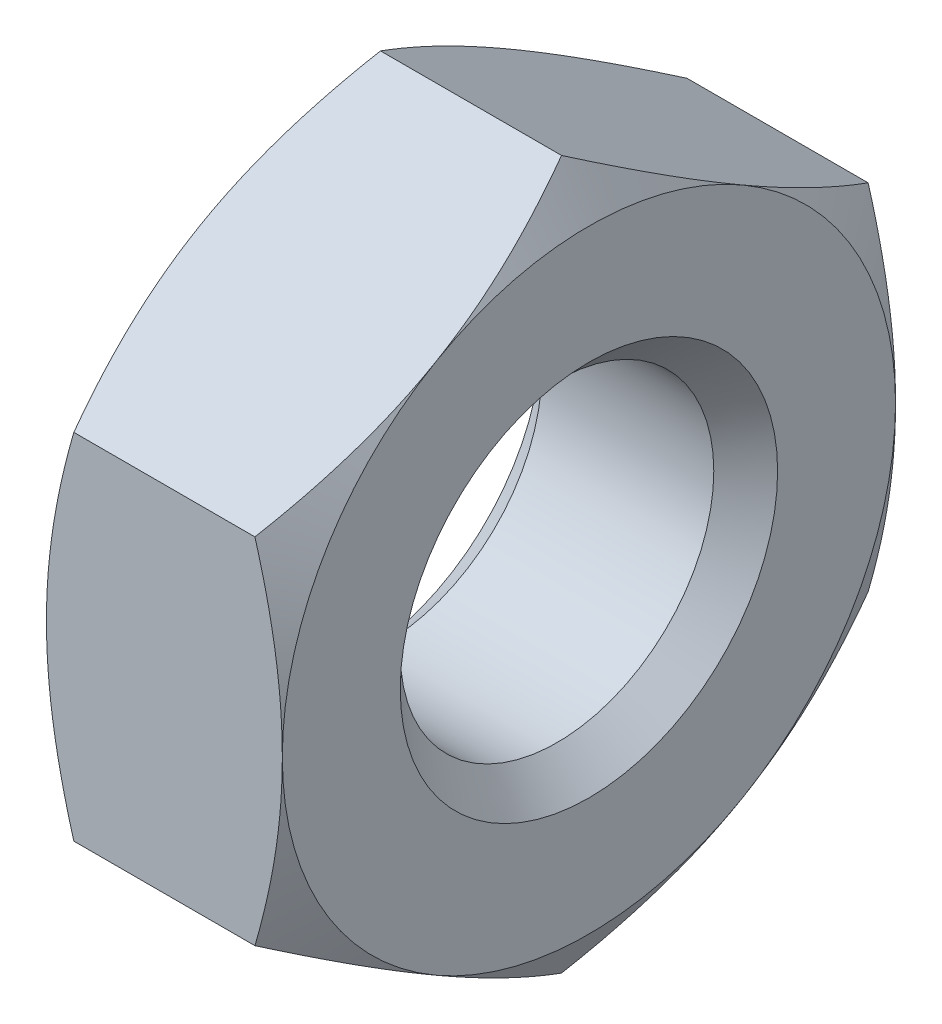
ISO-10303-21;
HEADER;
FILE_DESCRIPTION(('STEP AP214'),'2;1');
FILE_NAME('part.step','',(''),(''),'','','');
FILE_SCHEMA(('AUTOMOTIVE_DESIGN { 1 0 10303 214 1 1 1 1 }'));
ENDSEC;
DATA;
#1=APPLICATION_CONTEXT('core data for automotive mechanical design processes');
#2=APPLICATION_PROTOCOL_DEFINITION('international standard','automotive_design',2000,#1);
#3=PRODUCT_CONTEXT('',#1,'mechanical');
#4=PRODUCT('Part','Part','',(#3));
#5=PRODUCT_RELATED_PRODUCT_CATEGORY('part','',(#4));
#6=PRODUCT_DEFINITION_FORMATION('','',#4);
#7=PRODUCT_DEFINITION_CONTEXT('part definition',#1,'design');
#8=PRODUCT_DEFINITION('design','',#6,#7);
#9=PRODUCT_DEFINITION_SHAPE('','',#8);
#10=(LENGTH_UNIT() NAMED_UNIT(*) SI_UNIT(.MILLI.,.METRE.));
#11=(NAMED_UNIT(*) PLANE_ANGLE_UNIT() SI_UNIT($,.RADIAN.));
#12=(NAMED_UNIT(*) SI_UNIT($,.STERADIAN.) SOLID_ANGLE_UNIT());
#13=UNCERTAINTY_MEASURE_WITH_UNIT(LENGTH_MEASURE(1.E-05),#10,'distance_accuracy_value','');
#14=(GEOMETRIC_REPRESENTATION_CONTEXT(3) GLOBAL_UNCERTAINTY_ASSIGNED_CONTEXT((#13)) GLOBAL_UNIT_ASSIGNED_CONTEXT((#10,
#11,#12)) REPRESENTATION_CONTEXT('',''));
#15=CARTESIAN_POINT('',(0.,0.,0.));
#16=DIRECTION('',(0.,0.,1.));
#17=DIRECTION('',(1.,0.,0.));
#18=AXIS2_PLACEMENT_3D('',#15,#16,#17);
#19=CARTESIAN_POINT('',(0.750555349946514,0.,0.));
#20=DIRECTION('',(1.,0.,0.));
#21=DIRECTION('',(0.,0.,-1.));
#22=AXIS2_PLACEMENT_3D('',#19,#20,#21);
#23=CONICAL_SURFACE('',#22,7.8,1.0471975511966);
#24=CARTESIAN_POINT('',(0.580623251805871,-3.75266127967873,-6.5002));
#25=CARTESIAN_POINT('',(0.53300442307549,-3.83515161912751,-6.35732254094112));
#26=CARTESIAN_POINT('',(0.487546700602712,-3.91794952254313,-6.21391236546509));
#27=CARTESIAN_POINT('',(0.401548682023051,-4.08421773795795,-5.92592736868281));
#28=CARTESIAN_POINT('',(0.36101050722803,-4.16768832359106,-5.78135207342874));
#29=CARTESIAN_POINT('',(0.247571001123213,-4.41943655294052,-5.34531134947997));
#30=CARTESIAN_POINT('',(0.183047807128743,-4.5887079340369,-5.05212471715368));
#31=CARTESIAN_POINT('',(0.107386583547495,-4.84201947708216,-4.61337625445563));
#32=CARTESIAN_POINT('',(0.085832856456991,-4.92530276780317,-4.46912536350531));
#33=CARTESIAN_POINT('',(0.0496903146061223,-5.09224566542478,-4.17997178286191));
#34=CARTESIAN_POINT('',(0.0351008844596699,-5.17590523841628,-4.03506915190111));
#35=CARTESIAN_POINT('',(0.0132587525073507,-5.34336968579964,-3.74501222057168));
#36=CARTESIAN_POINT('',(0.00599772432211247,-5.42717428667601,-3.59985839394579));
#37=CARTESIAN_POINT('',(-0.00103969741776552,-5.59485627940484,-3.30942466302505));
#38=CARTESIAN_POINT('',(-0.000816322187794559,-5.6787336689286,-3.16414476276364));
#39=CARTESIAN_POINT('',(0.010083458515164,-5.90853103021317,-2.7661240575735));
#40=CARTESIAN_POINT('',(0.0283818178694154,-6.05437578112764,-2.51351353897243));
#41=CARTESIAN_POINT('',(0.0864063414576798,-6.34509659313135,-2.00997032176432));
#42=CARTESIAN_POINT('',(0.126152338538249,-6.48997163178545,-1.75903939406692));
#43=CARTESIAN_POINT('',(0.225505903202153,-6.78127752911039,-1.25448277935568));
#44=CARTESIAN_POINT('',(0.285534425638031,-6.92767163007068,-1.00092075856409));
#45=CARTESIAN_POINT('',(0.421774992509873,-7.21827667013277,-0.497578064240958));
#46=CARTESIAN_POINT('',(0.497955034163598,-7.36249133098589,-0.247790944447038));
#47=CARTESIAN_POINT('',(0.58062325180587,-7.50566896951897,0.000199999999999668));
#48=B_SPLINE_CURVE_WITH_KNOTS('',3,(#24,#25,#26,#27,#28,#29,#30,#31,#32,#33,#34,#35,#36,#37,#38,
#39,#40,#41,#42,#43,#44,#45,#46,#47),.UNSPECIFIED.,.F.,.F.,(4,2,2,2,2,2,2,2,2,2,2,4),(0.,
0.515105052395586,1.03043143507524,2.06322554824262,2.56697389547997,3.07067772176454,
3.57380860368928,4.0769239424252,4.9527935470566,5.82947446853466,6.72559912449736,
7.61996451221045),.UNSPECIFIED.);
#49=CARTESIAN_POINT('',(0.,-5.62916512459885,-3.25));
#50=VERTEX_POINT('',#49);
#51=CARTESIAN_POINT('',(0.580556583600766,-7.50555349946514,0.));
#52=VERTEX_POINT('',#51);
#53=EDGE_CURVE('E274',#50,#52,#48,.T.);
#54=ORIENTED_EDGE('',*,*,#53,.T.);
#55=CARTESIAN_POINT('',(0.58062325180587,-7.50566896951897,-0.000199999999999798));
#56=CARTESIAN_POINT('',(0.533004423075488,-7.4231786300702,0.142677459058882));
#57=CARTESIAN_POINT('',(0.487546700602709,-7.34038072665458,0.286087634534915));
#58=CARTESIAN_POINT('',(0.401548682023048,-7.17411251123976,0.574072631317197));
#59=CARTESIAN_POINT('',(0.361010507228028,-7.09064192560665,0.718647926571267));
#60=CARTESIAN_POINT('',(0.247571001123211,-6.83889369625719,1.15468865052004));
#61=CARTESIAN_POINT('',(0.183047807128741,-6.66962231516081,1.44787528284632));
#62=CARTESIAN_POINT('',(0.107386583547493,-6.41631077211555,1.88662374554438));
#63=CARTESIAN_POINT('',(0.085832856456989,-6.33302748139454,2.03087463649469));
#64=CARTESIAN_POINT('',(0.0496903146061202,-6.16608458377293,2.32002821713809));
#65=CARTESIAN_POINT('',(0.0351008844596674,-6.08242501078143,2.46493084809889));
#66=CARTESIAN_POINT('',(0.0132587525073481,-5.91496056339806,2.75498777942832));
#67=CARTESIAN_POINT('',(0.00599772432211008,-5.8311559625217,2.90014160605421));
#68=CARTESIAN_POINT('',(-0.00103969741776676,-5.66347396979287,3.19057533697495));
#69=CARTESIAN_POINT('',(-0.00081632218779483,-5.5795965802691,3.33585523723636));
#70=CARTESIAN_POINT('',(0.0100834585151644,-5.34979921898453,3.7338759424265));
#71=CARTESIAN_POINT('',(0.0283818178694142,-5.20395446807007,3.98648646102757));
#72=CARTESIAN_POINT('',(0.0864063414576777,-4.91323365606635,4.49002967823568));
#73=CARTESIAN_POINT('',(0.126152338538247,-4.76835861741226,4.74096060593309));
#74=CARTESIAN_POINT('',(0.225505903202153,-4.47705272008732,5.24551722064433));
#75=CARTESIAN_POINT('',(0.28553442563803,-4.33065861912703,5.49907924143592));
#76=CARTESIAN_POINT('',(0.421774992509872,-4.04005357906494,6.00242193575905));
#77=CARTESIAN_POINT('',(0.497955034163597,-3.89583891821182,6.25220905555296));
#78=CARTESIAN_POINT('',(0.58062325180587,-3.75266127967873,6.5002));
#79=B_SPLINE_CURVE_WITH_KNOTS('',3,(#55,#56,#57,#58,#59,#60,#61,#62,#63,#64,#65,#66,#67,#68,#69,
#70,#71,#72,#73,#74,#75,#76,#77,#78),.UNSPECIFIED.,.F.,.F.,(4,2,2,2,2,2,2,2,2,2,2,4),(0.,
0.515105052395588,1.03043143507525,2.06322554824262,2.56697389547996,3.07067772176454,
3.57380860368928,4.0769239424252,4.9527935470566,5.82947446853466,6.72559912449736,
7.61996451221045),.UNSPECIFIED.);
#80=CARTESIAN_POINT('',(0.,-5.62916512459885,3.25));
#81=VERTEX_POINT('',#80);
#82=EDGE_CURVE('E222',#52,#81,#79,.T.);
#83=ORIENTED_EDGE('',*,*,#82,.T.);
#84=CARTESIAN_POINT('',(0.,0.,0.));
#85=DIRECTION('',(-1.,0.,0.));
#86=DIRECTION('',(0.,0.,1.));
#87=AXIS2_PLACEMENT_3D('',#84,#85,#86);
#88=CIRCLE('',#87,6.5);
#89=EDGE_CURVE('E252',#50,#81,#88,.T.);
#90=ORIENTED_EDGE('',*,*,#89,.F.);
#91=EDGE_LOOP('',(#54,#83,#90));
#92=FACE_BOUND('',#91,.T.);
#93=ADVANCED_FACE('F16',(#92),#23,.T.);
#94=CARTESIAN_POINT('',(0.,0.,6.5));
#95=VERTEX_POINT('',#94);
#96=EDGE_CURVE('E25',#81,#95,#88,.T.);
#97=ORIENTED_EDGE('',*,*,#96,.F.);
#98=CARTESIAN_POINT('',(0.580556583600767,-3.75277674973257,6.5));
#99=VERTEX_POINT('',#98);
#100=EDGE_CURVE('E223',#81,#99,#79,.T.);
#101=ORIENTED_EDGE('',*,*,#100,.T.);
#102=CARTESIAN_POINT('',(3.12183501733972,-9.97651546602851,6.5));
#103=CARTESIAN_POINT('',(2.98495508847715,-9.6934728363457,6.5));
#104=CARTESIAN_POINT('',(2.84941805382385,-9.40976918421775,6.5));
#105=CARTESIAN_POINT('',(2.58178722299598,-8.84068788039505,6.5));
#106=CARTESIAN_POINT('',(2.44969399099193,-8.55530996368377,6.5));
#107=CARTESIAN_POINT('',(2.18902122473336,-7.98100727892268,6.5));
#108=CARTESIAN_POINT('',(2.0604656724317,-7.6920715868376,6.5));
#109=CARTESIAN_POINT('',(1.80875631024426,-7.11186545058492,6.5));
#110=CARTESIAN_POINT('',(1.68560223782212,-6.82059512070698,6.5));
#111=CARTESIAN_POINT('',(1.4424463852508,-6.22626365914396,6.5));
#112=CARTESIAN_POINT('',(1.3226573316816,-5.92311500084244,6.5));
#113=CARTESIAN_POINT('',(1.09239953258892,-5.31323360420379,6.5));
#114=CARTESIAN_POINT('',(0.981931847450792,-5.00650046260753,6.5));
#115=CARTESIAN_POINT('',(0.773293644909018,-4.3895669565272,6.5));
#116=CARTESIAN_POINT('',(0.675097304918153,-4.0793754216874,6.5));
#117=CARTESIAN_POINT('',(0.494219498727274,-3.45455611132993,6.5));
#118=CARTESIAN_POINT('',(0.411533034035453,-3.13992980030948,6.5));
#119=CARTESIAN_POINT('',(0.266150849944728,-2.50773581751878,6.5));
#120=CARTESIAN_POINT('',(0.2033506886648,-2.1901928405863,6.5));
#121=CARTESIAN_POINT('',(0.126834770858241,-1.71107137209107,6.5));
#122=CARTESIAN_POINT('',(0.10427576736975,-1.55088359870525,6.5));
#123=CARTESIAN_POINT('',(0.0654973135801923,-1.22974840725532,6.5));
#124=CARTESIAN_POINT('',(0.0492772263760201,-1.06880106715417,6.5));
#125=CARTESIAN_POINT('',(0.0236976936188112,-0.748417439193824,6.5));
#126=CARTESIAN_POINT('',(0.0142537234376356,-0.588987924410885,6.5));
#127=CARTESIAN_POINT('',(0.00210835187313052,-0.269872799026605,6.5));
#128=CARTESIAN_POINT('',(-0.000593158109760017,-0.11018719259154,6.5));
#129=CARTESIAN_POINT('',(0.000810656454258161,0.209155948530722,6.5));
#130=CARTESIAN_POINT('',(0.00491602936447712,0.368813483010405,6.5));
#131=CARTESIAN_POINT('',(0.0198352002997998,0.687816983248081,6.5));
#132=CARTESIAN_POINT('',(0.0306493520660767,0.847162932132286,6.5));
#133=CARTESIAN_POINT('',(0.0647613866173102,1.23333266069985,6.5));
#134=CARTESIAN_POINT('',(0.0914204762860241,1.45986546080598,6.5));
#135=CARTESIAN_POINT('',(0.156818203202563,1.91116991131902,6.5));
#136=CARTESIAN_POINT('',(0.195558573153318,2.13594130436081,6.5));
#137=CARTESIAN_POINT('',(0.327840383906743,2.80740180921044,6.5));
#138=CARTESIAN_POINT('',(0.437415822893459,3.25096947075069,6.5));
#139=CARTESIAN_POINT('',(0.626414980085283,3.91407602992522,6.5));
#140=CARTESIAN_POINT('',(0.694374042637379,4.137079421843,6.5));
#141=CARTESIAN_POINT('',(0.837098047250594,4.58091888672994,6.5));
#142=CARTESIAN_POINT('',(0.911863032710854,4.80175494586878,6.5));
#143=CARTESIAN_POINT('',(1.06702048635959,5.2413340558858,6.5));
#144=CARTESIAN_POINT('',(1.14741093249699,5.46007782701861,6.5));
#145=CARTESIAN_POINT('',(1.31289876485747,5.89577034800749,6.5));
#146=CARTESIAN_POINT('',(1.39799610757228,6.1127191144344,6.5));
#147=CARTESIAN_POINT('',(1.59636244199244,6.60523427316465,6.5));
#148=CARTESIAN_POINT('',(1.71087670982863,6.88029803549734,6.5));
#149=CARTESIAN_POINT('',(1.94502641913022,7.42824284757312,6.5));
#150=CARTESIAN_POINT('',(2.06466210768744,7.7011237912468,6.5));
#151=CARTESIAN_POINT('',(2.30807643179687,8.24508157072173,6.5));
#152=CARTESIAN_POINT('',(2.43185575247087,8.51615809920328,6.5));
#153=CARTESIAN_POINT('',(2.6827757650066,9.0567531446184,6.5));
#154=CARTESIAN_POINT('',(2.80991651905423,9.32627163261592,6.5));
#155=CARTESIAN_POINT('',(3.19566804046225,10.1333232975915,6.5));
#156=CARTESIAN_POINT('',(3.45839707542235,10.6688870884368,6.5));
#157=CARTESIAN_POINT('',(3.9914219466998,11.7362351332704,6.5));
#158=CARTESIAN_POINT('',(4.26171803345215,12.268019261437,6.5));
#159=CARTESIAN_POINT('',(4.66061827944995,13.0429212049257,6.5));
#160=CARTESIAN_POINT('',(4.78707421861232,13.2871481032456,6.5));
#161=CARTESIAN_POINT('',(5.04099732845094,13.7750704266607,6.5));
#162=CARTESIAN_POINT('',(5.16846448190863,14.0187658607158,6.5));
#163=CARTESIAN_POINT('',(5.5521928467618,14.749177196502,6.5));
#164=CARTESIAN_POINT('',(5.80977200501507,15.235200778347,6.5));
#165=CARTESIAN_POINT('',(6.32705877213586,16.2047384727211,6.5));
#166=CARTESIAN_POINT('',(6.5867604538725,16.6882557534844,6.5));
#167=CARTESIAN_POINT('',(7.10829861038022,17.6541075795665,6.5));
#168=CARTESIAN_POINT('',(7.37013498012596,18.1364421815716,6.5));
#169=CARTESIAN_POINT('',(7.63277579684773,18.6183355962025,6.5));
#170=B_SPLINE_CURVE_WITH_KNOTS('',3,(#102,#103,#104,#105,#106,#107,#108,#109,#110,#111,#112,
#113,#114,#115,#116,#117,#118,#119,#120,#121,#122,#123,#124,#125,#126,#127,#128,#129,#130,#131,
#132,#133,#134,#135,#136,#137,#138,#139,#140,#141,#142,#143,#144,#145,#146,#147,#148,#149,#150,
#151,#152,#153,#154,#155,#156,#157,#158,#159,#160,#161,#162,#163,#164,#165,#166,#167,#168,#169),
.UNSPECIFIED.,.F.,.F.,(4,2,2,2,2,2,2,2,2,2,2,2,2,2,2,2,2,2,2,2,2,2,2,2,2,2,2,2,2,2,2,2,2,4),(0.,
0.943221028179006,1.8865956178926,2.83528383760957,3.78392589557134,4.76168061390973,
5.7395464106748,6.71531853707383,7.69077565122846,8.66102131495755,9.1462209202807,
9.63137176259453,10.1103603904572,10.5893413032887,11.0683256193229,11.5473351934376,
12.231234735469,12.9152324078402,14.2840314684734,14.983362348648,15.6826976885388,
16.3817829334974,17.0808617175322,17.9746407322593,18.8684629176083,19.7624336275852,
20.6564208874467,22.4459285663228,24.2354955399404,25.0605638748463,25.8856181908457,
27.5357854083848,29.1823233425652,30.828780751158),.UNSPECIFIED.);
#171=EDGE_CURVE('E232',#99,#95,#170,.T.);
#172=ORIENTED_EDGE('',*,*,#171,.T.);
#173=EDGE_LOOP('',(#97,#101,#172));
#174=FACE_BOUND('',#173,.T.);
#175=ADVANCED_FACE('F310',(#174),#23,.T.);
#176=CARTESIAN_POINT('',(0.,5.62916512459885,3.25));
#177=VERTEX_POINT('',#176);
#178=EDGE_CURVE('E11',#95,#177,#88,.T.);
#179=ORIENTED_EDGE('',*,*,#178,.F.);
#180=CARTESIAN_POINT('',(0.580556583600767,3.75277674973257,6.5));
#181=VERTEX_POINT('',#180);
#182=EDGE_CURVE('E135',#95,#181,#170,.T.);
#183=ORIENTED_EDGE('',*,*,#182,.T.);
#184=CARTESIAN_POINT('',(0.580623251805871,3.75266127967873,6.5002));
#185=CARTESIAN_POINT('',(0.53300442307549,3.83515161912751,6.35732254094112));
#186=CARTESIAN_POINT('',(0.487546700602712,3.91794952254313,6.21391236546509));
#187=CARTESIAN_POINT('',(0.401548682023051,4.08421773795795,5.92592736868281));
#188=CARTESIAN_POINT('',(0.36101050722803,4.16768832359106,5.78135207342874));
#189=CARTESIAN_POINT('',(0.247571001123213,4.41943655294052,5.34531134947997));
#190=CARTESIAN_POINT('',(0.183047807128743,4.5887079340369,5.05212471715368));
#191=CARTESIAN_POINT('',(0.107386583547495,4.84201947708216,4.61337625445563));
#192=CARTESIAN_POINT('',(0.085832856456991,4.92530276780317,4.46912536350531));
#193=CARTESIAN_POINT('',(0.0496903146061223,5.09224566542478,4.17997178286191));
#194=CARTESIAN_POINT('',(0.0351008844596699,5.17590523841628,4.03506915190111));
#195=CARTESIAN_POINT('',(0.0132587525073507,5.34336968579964,3.74501222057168));
#196=CARTESIAN_POINT('',(0.00599772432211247,5.42717428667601,3.59985839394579));
#197=CARTESIAN_POINT('',(-0.00103969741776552,5.59485627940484,3.30942466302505));
#198=CARTESIAN_POINT('',(-0.000816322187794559,5.6787336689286,3.16414476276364));
#199=CARTESIAN_POINT('',(0.010083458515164,5.90853103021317,2.7661240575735));
#200=CARTESIAN_POINT('',(0.0283818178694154,6.05437578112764,2.51351353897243));
#201=CARTESIAN_POINT('',(0.0864063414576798,6.34509659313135,2.00997032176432));
#202=CARTESIAN_POINT('',(0.126152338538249,6.48997163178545,1.75903939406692));
#203=CARTESIAN_POINT('',(0.225505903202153,6.78127752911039,1.25448277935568));
#204=CARTESIAN_POINT('',(0.285534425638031,6.92767163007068,1.00092075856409));
#205=CARTESIAN_POINT('',(0.421774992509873,7.21827667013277,0.497578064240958));
#206=CARTESIAN_POINT('',(0.497955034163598,7.36249133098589,0.247790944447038));
#207=CARTESIAN_POINT('',(0.58062325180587,7.50566896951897,-0.000199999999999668));
#208=B_SPLINE_CURVE_WITH_KNOTS('',3,(#184,#185,#186,#187,#188,#189,#190,#191,#192,#193,#194,
#195,#196,#197,#198,#199,#200,#201,#202,#203,#204,#205,#206,#207),.UNSPECIFIED.,.F.,.F.,(4,2,2,
2,2,2,2,2,2,2,2,4),(0.,0.515105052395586,1.03043143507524,2.06322554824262,2.56697389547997,
3.07067772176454,3.57380860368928,4.0769239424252,4.9527935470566,5.82947446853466,
6.72559912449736,7.61996451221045),.UNSPECIFIED.);
#209=EDGE_CURVE('E136',#181,#177,#208,.T.);
#210=ORIENTED_EDGE('',*,*,#209,.T.);
#211=EDGE_LOOP('',(#179,#183,#210));
#212=FACE_BOUND('',#211,.T.);
#213=ADVANCED_FACE('F134',(#212),#23,.T.);
#214=CARTESIAN_POINT('',(3.12183501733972,-9.97651546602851,-6.5));
#215=CARTESIAN_POINT('',(2.98495508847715,-9.6934728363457,-6.5));
#216=CARTESIAN_POINT('',(2.84941805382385,-9.40976918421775,-6.5));
#217=CARTESIAN_POINT('',(2.58178722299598,-8.84068788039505,-6.5));
#218=CARTESIAN_POINT('',(2.44969399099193,-8.55530996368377,-6.5));
#219=CARTESIAN_POINT('',(2.18902122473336,-7.98100727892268,-6.5));
#220=CARTESIAN_POINT('',(2.0604656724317,-7.6920715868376,-6.5));
#221=CARTESIAN_POINT('',(1.80875631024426,-7.11186545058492,-6.5));
#222=CARTESIAN_POINT('',(1.68560223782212,-6.82059512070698,-6.5));
#223=CARTESIAN_POINT('',(1.4424463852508,-6.22626365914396,-6.5));
#224=CARTESIAN_POINT('',(1.3226573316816,-5.92311500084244,-6.5));
#225=CARTESIAN_POINT('',(1.09239953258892,-5.31323360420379,-6.5));
#226=CARTESIAN_POINT('',(0.981931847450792,-5.00650046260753,-6.5));
#227=CARTESIAN_POINT('',(0.773293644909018,-4.3895669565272,-6.5));
#228=CARTESIAN_POINT('',(0.675097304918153,-4.0793754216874,-6.5));
#229=CARTESIAN_POINT('',(0.494219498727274,-3.45455611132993,-6.5));
#230=CARTESIAN_POINT('',(0.411533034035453,-3.13992980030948,-6.5));
#231=CARTESIAN_POINT('',(0.266150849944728,-2.50773581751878,-6.5));
#232=CARTESIAN_POINT('',(0.2033506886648,-2.1901928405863,-6.5));
#233=CARTESIAN_POINT('',(0.126834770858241,-1.71107137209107,-6.5));
#234=CARTESIAN_POINT('',(0.10427576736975,-1.55088359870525,-6.5));
#235=CARTESIAN_POINT('',(0.0654973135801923,-1.22974840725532,-6.5));
#236=CARTESIAN_POINT('',(0.0492772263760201,-1.06880106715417,-6.5));
#237=CARTESIAN_POINT('',(0.0236976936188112,-0.748417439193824,-6.5));
#238=CARTESIAN_POINT('',(0.0142537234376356,-0.588987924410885,-6.5));
#239=CARTESIAN_POINT('',(0.00210835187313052,-0.269872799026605,-6.5));
#240=CARTESIAN_POINT('',(-0.000593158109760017,-0.11018719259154,-6.5));
#241=CARTESIAN_POINT('',(0.000810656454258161,0.209155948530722,-6.5));
#242=CARTESIAN_POINT('',(0.00491602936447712,0.368813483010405,-6.5));
#243=CARTESIAN_POINT('',(0.0198352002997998,0.687816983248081,-6.5));
#244=CARTESIAN_POINT('',(0.0306493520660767,0.847162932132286,-6.5));
#245=CARTESIAN_POINT('',(0.0647613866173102,1.23333266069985,-6.5));
#246=CARTESIAN_POINT('',(0.0914204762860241,1.45986546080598,-6.5));
#247=CARTESIAN_POINT('',(0.156818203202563,1.91116991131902,-6.5));
#248=CARTESIAN_POINT('',(0.195558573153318,2.13594130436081,-6.5));
#249=CARTESIAN_POINT('',(0.327840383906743,2.80740180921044,-6.5));
#250=CARTESIAN_POINT('',(0.437415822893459,3.25096947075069,-6.5));
#251=CARTESIAN_POINT('',(0.626414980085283,3.91407602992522,-6.5));
#252=CARTESIAN_POINT('',(0.694374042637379,4.137079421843,-6.5));
#253=CARTESIAN_POINT('',(0.837098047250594,4.58091888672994,-6.5));
#254=CARTESIAN_POINT('',(0.911863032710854,4.80175494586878,-6.5));
#255=CARTESIAN_POINT('',(1.06702048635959,5.2413340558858,-6.5));
#256=CARTESIAN_POINT('',(1.14741093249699,5.46007782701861,-6.5));
#257=CARTESIAN_POINT('',(1.31289876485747,5.89577034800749,-6.5));
#258=CARTESIAN_POINT('',(1.39799610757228,6.1127191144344,-6.5));
#259=CARTESIAN_POINT('',(1.59636244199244,6.60523427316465,-6.5));
#260=CARTESIAN_POINT('',(1.71087670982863,6.88029803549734,-6.5));
#261=CARTESIAN_POINT('',(1.94502641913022,7.42824284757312,-6.5));
#262=CARTESIAN_POINT('',(2.06466210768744,7.7011237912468,-6.5));
#263=CARTESIAN_POINT('',(2.30807643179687,8.24508157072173,-6.5));
#264=CARTESIAN_POINT('',(2.43185575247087,8.51615809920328,-6.5));
#265=CARTESIAN_POINT('',(2.6827757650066,9.0567531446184,-6.5));
#266=CARTESIAN_POINT('',(2.80991651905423,9.32627163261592,-6.5));
#267=CARTESIAN_POINT('',(3.19566804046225,10.1333232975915,-6.5));
#268=CARTESIAN_POINT('',(3.45839707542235,10.6688870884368,-6.5));
#269=CARTESIAN_POINT('',(3.9914219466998,11.7362351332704,-6.5));
#270=CARTESIAN_POINT('',(4.26171803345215,12.268019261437,-6.5));
#271=CARTESIAN_POINT('',(4.66061827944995,13.0429212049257,-6.5));
#272=CARTESIAN_POINT('',(4.78707421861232,13.2871481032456,-6.5));
#273=CARTESIAN_POINT('',(5.04099732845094,13.7750704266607,-6.5));
#274=CARTESIAN_POINT('',(5.16846448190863,14.0187658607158,-6.5));
#275=CARTESIAN_POINT('',(5.5521928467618,14.749177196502,-6.5));
#276=CARTESIAN_POINT('',(5.80977200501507,15.235200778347,-6.5));
#277=CARTESIAN_POINT('',(6.32705877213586,16.2047384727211,-6.5));
#278=CARTESIAN_POINT('',(6.5867604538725,16.6882557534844,-6.5));
#279=CARTESIAN_POINT('',(7.10829861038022,17.6541075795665,-6.5));
#280=CARTESIAN_POINT('',(7.37013498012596,18.1364421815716,-6.5));
#281=CARTESIAN_POINT('',(7.63277579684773,18.6183355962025,-6.5));
#282=B_SPLINE_CURVE_WITH_KNOTS('',3,(#214,#215,#216,#217,#218,#219,#220,#221,#222,#223,#224,
#225,#226,#227,#228,#229,#230,#231,#232,#233,#234,#235,#236,#237,#238,#239,#240,#241,#242,#243,
#244,#245,#246,#247,#248,#249,#250,#251,#252,#253,#254,#255,#256,#257,#258,#259,#260,#261,#262,
#263,#264,#265,#266,#267,#268,#269,#270,#271,#272,#273,#274,#275,#276,#277,#278,#279,#280,#281),
.UNSPECIFIED.,.F.,.F.,(4,2,2,2,2,2,2,2,2,2,2,2,2,2,2,2,2,2,2,2,2,2,2,2,2,2,2,2,2,2,2,2,2,4),(0.,
0.943221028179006,1.8865956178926,2.83528383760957,3.78392589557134,4.76168061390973,
5.7395464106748,6.71531853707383,7.69077565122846,8.66102131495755,9.1462209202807,
9.63137176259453,10.1103603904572,10.5893413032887,11.0683256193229,11.5473351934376,
12.231234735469,12.9152324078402,14.2840314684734,14.983362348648,15.6826976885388,
16.3817829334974,17.0808617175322,17.9746407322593,18.8684629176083,19.7624336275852,
20.6564208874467,22.4459285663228,24.2354955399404,25.0605638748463,25.8856181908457,
27.5357854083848,29.1823233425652,30.828780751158),.UNSPECIFIED.);
#283=CARTESIAN_POINT('',(0.,0.,-6.5));
#284=VERTEX_POINT('',#283);
#285=CARTESIAN_POINT('',(0.580556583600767,-3.75277674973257,-6.5));
#286=VERTEX_POINT('',#285);
#287=EDGE_CURVE('E277',#284,#286,#282,.F.);
#288=ORIENTED_EDGE('',*,*,#287,.T.);
#289=EDGE_CURVE('E276',#286,#50,#48,.T.);
#290=ORIENTED_EDGE('',*,*,#289,.T.);
#291=EDGE_CURVE('E126',#284,#50,#88,.T.);
#292=ORIENTED_EDGE('',*,*,#291,.F.);
#293=EDGE_LOOP('',(#288,#290,#292));
#294=FACE_BOUND('',#293,.T.);
#295=ADVANCED_FACE('F324',(#294),#23,.T.);
#296=CARTESIAN_POINT('',(0.,5.62916512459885,-3.25));
#297=VERTEX_POINT('',#296);
#298=EDGE_CURVE('E24',#177,#297,#88,.T.);
#299=ORIENTED_EDGE('',*,*,#298,.F.);
#300=CARTESIAN_POINT('',(0.580556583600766,7.50555349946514,0.));
#301=VERTEX_POINT('',#300);
#302=EDGE_CURVE('E117',#177,#301,#208,.T.);
#303=ORIENTED_EDGE('',*,*,#302,.T.);
#304=CARTESIAN_POINT('',(0.58062325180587,7.50566896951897,0.000199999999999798));
#305=CARTESIAN_POINT('',(0.533004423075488,7.4231786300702,-0.142677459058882));
#306=CARTESIAN_POINT('',(0.487546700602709,7.34038072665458,-0.286087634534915));
#307=CARTESIAN_POINT('',(0.401548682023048,7.17411251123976,-0.574072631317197));
#308=CARTESIAN_POINT('',(0.361010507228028,7.09064192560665,-0.718647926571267));
#309=CARTESIAN_POINT('',(0.247571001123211,6.83889369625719,-1.15468865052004));
#310=CARTESIAN_POINT('',(0.183047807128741,6.66962231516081,-1.44787528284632));
#311=CARTESIAN_POINT('',(0.107386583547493,6.41631077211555,-1.88662374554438));
#312=CARTESIAN_POINT('',(0.085832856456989,6.33302748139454,-2.03087463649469));
#313=CARTESIAN_POINT('',(0.0496903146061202,6.16608458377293,-2.32002821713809));
#314=CARTESIAN_POINT('',(0.0351008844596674,6.08242501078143,-2.46493084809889));
#315=CARTESIAN_POINT('',(0.0132587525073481,5.91496056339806,-2.75498777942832));
#316=CARTESIAN_POINT('',(0.00599772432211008,5.8311559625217,-2.90014160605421));
#317=CARTESIAN_POINT('',(-0.00103969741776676,5.66347396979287,-3.19057533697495));
#318=CARTESIAN_POINT('',(-0.00081632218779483,5.5795965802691,-3.33585523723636));
#319=CARTESIAN_POINT('',(0.0100834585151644,5.34979921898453,-3.7338759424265));
#320=CARTESIAN_POINT('',(0.0283818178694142,5.20395446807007,-3.98648646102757));
#321=CARTESIAN_POINT('',(0.0864063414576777,4.91323365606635,-4.49002967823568));
#322=CARTESIAN_POINT('',(0.126152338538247,4.76835861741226,-4.74096060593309));
#323=CARTESIAN_POINT('',(0.225505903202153,4.47705272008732,-5.24551722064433));
#324=CARTESIAN_POINT('',(0.28553442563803,4.33065861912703,-5.49907924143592));
#325=CARTESIAN_POINT('',(0.421774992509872,4.04005357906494,-6.00242193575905));
#326=CARTESIAN_POINT('',(0.497955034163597,3.89583891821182,-6.25220905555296));
#327=CARTESIAN_POINT('',(0.58062325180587,3.75266127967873,-6.5002));
#328=B_SPLINE_CURVE_WITH_KNOTS('',3,(#304,#305,#306,#307,#308,#309,#310,#311,#312,#313,#314,
#315,#316,#317,#318,#319,#320,#321,#322,#323,#324,#325,#326,#327),.UNSPECIFIED.,.F.,.F.,(4,2,2,
2,2,2,2,2,2,2,2,4),(0.,0.515105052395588,1.03043143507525,2.06322554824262,2.56697389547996,
3.07067772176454,3.57380860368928,4.0769239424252,4.9527935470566,5.82947446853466,
6.72559912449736,7.61996451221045),.UNSPECIFIED.);
#329=EDGE_CURVE('E106',#301,#297,#328,.T.);
#330=ORIENTED_EDGE('',*,*,#329,.T.);
#331=EDGE_LOOP('',(#299,#303,#330));
#332=FACE_BOUND('',#331,.T.);
#333=ADVANCED_FACE('F115',(#332),#23,.T.);
#334=CARTESIAN_POINT('',(0.,0.,0.));
#335=DIRECTION('',(1.,0.,0.));
#336=DIRECTION('',(0.,0.,-1.));
#337=AXIS2_PLACEMENT_3D('',#334,#335,#336);
#338=PLANE('',#337);
#339=CARTESIAN_POINT('',(0.,0.,0.));
#340=DIRECTION('',(-1.,0.,0.));
#341=DIRECTION('',(0.,0.,1.));
#342=AXIS2_PLACEMENT_3D('',#339,#340,#341);
#343=CIRCLE('',#342,4.);
#344=CARTESIAN_POINT('',(0.,0.,4.));
#345=VERTEX_POINT('',#344);
#346=EDGE_CURVE('E401',#345,#345,#343,.T.);
#347=ORIENTED_EDGE('',*,*,#346,.F.);
#348=EDGE_LOOP('',(#347));
#349=FACE_BOUND('',#348,.T.);
#350=ORIENTED_EDGE('',*,*,#178,.T.);
#351=ORIENTED_EDGE('',*,*,#298,.T.);
#352=EDGE_CURVE('E120',#297,#284,#88,.T.);
#353=ORIENTED_EDGE('',*,*,#352,.T.);
#354=ORIENTED_EDGE('',*,*,#291,.T.);
#355=ORIENTED_EDGE('',*,*,#89,.T.);
#356=ORIENTED_EDGE('',*,*,#96,.T.);
#357=EDGE_LOOP('',(#350,#351,#353,#354,#355,#356));
#358=FACE_BOUND('',#357,.T.);
#359=ADVANCED_FACE('F18',(#349,#358),#338,.F.);
#360=CARTESIAN_POINT('',(0.580556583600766,3.75277674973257,-6.5));
#361=VERTEX_POINT('',#360);
#362=EDGE_CURVE('E103',#297,#361,#328,.T.);
#363=ORIENTED_EDGE('',*,*,#362,.T.);
#364=EDGE_CURVE('E122',#361,#284,#282,.F.);
#365=ORIENTED_EDGE('',*,*,#364,.T.);
#366=ORIENTED_EDGE('',*,*,#352,.F.);
#367=EDGE_LOOP('',(#363,#365,#366));
#368=FACE_BOUND('',#367,.T.);
#369=ADVANCED_FACE('F121',(#368),#23,.T.);
#370=CARTESIAN_POINT('',(10.,7.50555349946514,0.));
#371=DIRECTION('',(0.,-0.866025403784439,-0.5));
#372=DIRECTION('',(0.,0.5,-0.866025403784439));
#373=AXIS2_PLACEMENT_3D('',#370,#371,#372);
#374=PLANE('',#373);
#375=DIRECTION('',(-1.,0.,0.));
#376=VECTOR('',#375,1.);
#377=CARTESIAN_POINT('',(10.,3.75277674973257,6.5));
#378=LINE('',#377,#376);
#379=CARTESIAN_POINT('',(4.41944341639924,3.75277674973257,6.5));
#380=VERTEX_POINT('',#379);
#381=EDGE_CURVE('E347',#380,#181,#378,.T.);
#382=ORIENTED_EDGE('',*,*,#381,.F.);
#383=CARTESIAN_POINT('',(4.41937674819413,7.50566896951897,-0.000200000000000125));
#384=CARTESIAN_POINT('',(4.46699557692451,7.4231786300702,0.142677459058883));
#385=CARTESIAN_POINT('',(4.51245329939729,7.34038072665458,0.286087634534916));
#386=CARTESIAN_POINT('',(4.59845131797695,7.17411251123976,0.574072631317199));
#387=CARTESIAN_POINT('',(4.63898949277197,7.09064192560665,0.718647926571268));
#388=CARTESIAN_POINT('',(4.75242899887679,6.83889369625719,1.15468865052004));
#389=CARTESIAN_POINT('',(4.81695219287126,6.66962231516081,1.44787528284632));
#390=CARTESIAN_POINT('',(4.89261341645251,6.41631077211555,1.88662374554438));
#391=CARTESIAN_POINT('',(4.91416714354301,6.33302748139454,2.0308746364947));
#392=CARTESIAN_POINT('',(4.95030968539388,6.16608458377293,2.32002821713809));
#393=CARTESIAN_POINT('',(4.96489911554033,6.08242501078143,2.46493084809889));
#394=CARTESIAN_POINT('',(4.98674124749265,5.91496056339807,2.75498777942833));
#395=CARTESIAN_POINT('',(4.99400227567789,5.8311559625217,2.90014160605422));
#396=CARTESIAN_POINT('',(5.00103969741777,5.66347396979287,3.19057533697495));
#397=CARTESIAN_POINT('',(5.0008163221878,5.5795965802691,3.33585523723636));
#398=CARTESIAN_POINT('',(4.98991654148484,5.34979921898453,3.7338759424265));
#399=CARTESIAN_POINT('',(4.97161818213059,5.20395446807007,3.98648646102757));
#400=CARTESIAN_POINT('',(4.91359365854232,4.91323365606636,4.49002967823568));
#401=CARTESIAN_POINT('',(4.87384766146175,4.76835861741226,4.74096060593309));
#402=CARTESIAN_POINT('',(4.77449409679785,4.47705272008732,5.24551722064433));
#403=CARTESIAN_POINT('',(4.71446557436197,4.33065861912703,5.49907924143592));
#404=CARTESIAN_POINT('',(4.57822500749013,4.04005357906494,6.00242193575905));
#405=CARTESIAN_POINT('',(4.5020449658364,3.89583891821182,6.25220905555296));
#406=CARTESIAN_POINT('',(4.41937674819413,3.75266127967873,6.5002));
#407=B_SPLINE_CURVE_WITH_KNOTS('',3,(#383,#384,#385,#386,#387,#388,#389,#390,#391,#392,#393,
#394,#395,#396,#397,#398,#399,#400,#401,#402,#403,#404,#405,#406),.UNSPECIFIED.,.F.,.F.,(4,2,2,
2,2,2,2,2,2,2,2,4),(0.,0.515105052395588,1.03043143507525,2.06322554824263,2.56697389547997,
3.07067772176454,3.57380860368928,4.0769239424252,4.9527935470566,5.82947446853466,
6.72559912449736,7.61996451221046),.UNSPECIFIED.);
#408=CARTESIAN_POINT('',(5.,5.62916512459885,3.25));
#409=VERTEX_POINT('',#408);
#410=EDGE_CURVE('E152',#409,#380,#407,.T.);
#411=ORIENTED_EDGE('',*,*,#410,.F.);
#412=CARTESIAN_POINT('',(4.41944341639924,7.50555349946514,0.));
#413=VERTEX_POINT('',#412);
#414=EDGE_CURVE('E145',#413,#409,#407,.T.);
#415=ORIENTED_EDGE('',*,*,#414,.F.);
#416=DIRECTION('',(-1.,0.,0.));
#417=VECTOR('',#416,1.);
#418=CARTESIAN_POINT('',(10.,7.50555349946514,0.));
#419=LINE('',#418,#417);
#420=EDGE_CURVE('E39',#413,#301,#419,.T.);
#421=ORIENTED_EDGE('',*,*,#420,.T.);
#422=ORIENTED_EDGE('',*,*,#302,.F.);
#423=ORIENTED_EDGE('',*,*,#209,.F.);
#424=EDGE_LOOP('',(#382,#411,#415,#421,#422,#423));
#425=FACE_BOUND('',#424,.T.);
#426=ADVANCED_FACE('F160',(#425),#374,.F.);
#427=CARTESIAN_POINT('',(10.,3.75277674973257,6.5));
#428=DIRECTION('',(0.,0.,-1.));
#429=DIRECTION('',(-1.,0.,0.));
#430=AXIS2_PLACEMENT_3D('',#427,#428,#429);
#431=PLANE('',#430);
#432=DIRECTION('',(-1.,0.,0.));
#433=VECTOR('',#432,1.);
#434=CARTESIAN_POINT('',(10.,-3.75277674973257,6.5));
#435=LINE('',#434,#433);
#436=CARTESIAN_POINT('',(4.41944341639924,-3.75277674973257,6.5));
#437=VERTEX_POINT('',#436);
#438=EDGE_CURVE('E341',#437,#99,#435,.T.);
#439=ORIENTED_EDGE('',*,*,#438,.F.);
#440=CARTESIAN_POINT('',(1.87816498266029,-9.97651546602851,6.5));
#441=CARTESIAN_POINT('',(2.01504491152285,-9.6934728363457,6.5));
#442=CARTESIAN_POINT('',(2.15058194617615,-9.40976918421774,6.5));
#443=CARTESIAN_POINT('',(2.41821277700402,-8.84068788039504,6.5));
#444=CARTESIAN_POINT('',(2.55030600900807,-8.55530996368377,6.5));
#445=CARTESIAN_POINT('',(2.81097877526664,-7.98100727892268,6.5));
#446=CARTESIAN_POINT('',(2.9395343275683,-7.6920715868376,6.5));
#447=CARTESIAN_POINT('',(3.19124368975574,-7.11186545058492,6.5));
#448=CARTESIAN_POINT('',(3.31439776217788,-6.82059512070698,6.5));
#449=CARTESIAN_POINT('',(3.5575536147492,-6.22626365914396,6.5));
#450=CARTESIAN_POINT('',(3.6773426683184,-5.92311500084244,6.5));
#451=CARTESIAN_POINT('',(3.90760046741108,-5.31323360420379,6.5));
#452=CARTESIAN_POINT('',(4.01806815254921,-5.00650046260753,6.5));
#453=CARTESIAN_POINT('',(4.22670635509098,-4.3895669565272,6.5));
#454=CARTESIAN_POINT('',(4.32490269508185,-4.0793754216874,6.5));
#455=CARTESIAN_POINT('',(4.50578050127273,-3.45455611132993,6.5));
#456=CARTESIAN_POINT('',(4.58846696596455,-3.13992980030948,6.5));
#457=CARTESIAN_POINT('',(4.73384915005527,-2.50773581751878,6.5));
#458=CARTESIAN_POINT('',(4.7966493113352,-2.1901928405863,6.5));
#459=CARTESIAN_POINT('',(4.87316522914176,-1.71107137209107,6.5));
#460=CARTESIAN_POINT('',(4.89572423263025,-1.55088359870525,6.5));
#461=CARTESIAN_POINT('',(4.93450268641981,-1.22974840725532,6.5));
#462=CARTESIAN_POINT('',(4.95072277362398,-1.06880106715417,6.5));
#463=CARTESIAN_POINT('',(4.97630230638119,-0.748417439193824,6.5));
#464=CARTESIAN_POINT('',(4.98574627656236,-0.588987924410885,6.5));
#465=CARTESIAN_POINT('',(4.99789164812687,-0.269872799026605,6.5));
#466=CARTESIAN_POINT('',(5.00059315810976,-0.11018719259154,6.5));
#467=CARTESIAN_POINT('',(4.99918934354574,0.209155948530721,6.5));
#468=CARTESIAN_POINT('',(4.99508397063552,0.368813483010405,6.5));
#469=CARTESIAN_POINT('',(4.9801647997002,0.68781698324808,6.5));
#470=CARTESIAN_POINT('',(4.96935064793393,0.847162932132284,6.5));
#471=CARTESIAN_POINT('',(4.93523861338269,1.23333266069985,6.5));
#472=CARTESIAN_POINT('',(4.90857952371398,1.45986546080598,6.5));
#473=CARTESIAN_POINT('',(4.84318179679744,1.91116991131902,6.5));
#474=CARTESIAN_POINT('',(4.80444142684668,2.13594130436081,6.5));
#475=CARTESIAN_POINT('',(4.67215961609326,2.80740180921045,6.5));
#476=CARTESIAN_POINT('',(4.56258417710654,3.25096947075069,6.5));
#477=CARTESIAN_POINT('',(4.37358501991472,3.91407602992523,6.5));
#478=CARTESIAN_POINT('',(4.30562595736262,4.137079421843,6.5));
#479=CARTESIAN_POINT('',(4.1629019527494,4.58091888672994,6.5));
#480=CARTESIAN_POINT('',(4.08813696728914,4.80175494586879,6.5));
#481=CARTESIAN_POINT('',(3.93297951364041,5.24133405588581,6.5));
#482=CARTESIAN_POINT('',(3.85258906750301,5.46007782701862,6.5));
#483=CARTESIAN_POINT('',(3.68710123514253,5.8957703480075,6.5));
#484=CARTESIAN_POINT('',(3.60200389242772,6.11271911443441,6.5));
#485=CARTESIAN_POINT('',(3.40363755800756,6.60523427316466,6.5));
#486=CARTESIAN_POINT('',(3.28912329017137,6.88029803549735,6.5));
#487=CARTESIAN_POINT('',(3.05497358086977,7.42824284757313,6.5));
#488=CARTESIAN_POINT('',(2.93533789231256,7.7011237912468,6.5));
#489=CARTESIAN_POINT('',(2.69192356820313,8.24508157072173,6.5));
#490=CARTESIAN_POINT('',(2.56814424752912,8.51615809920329,6.5));
#491=CARTESIAN_POINT('',(2.3172242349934,9.0567531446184,6.5));
#492=CARTESIAN_POINT('',(2.19008348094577,9.32627163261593,6.5));
#493=CARTESIAN_POINT('',(1.80433195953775,10.1333232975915,6.5));
#494=CARTESIAN_POINT('',(1.54160292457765,10.6688870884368,6.5));
#495=CARTESIAN_POINT('',(1.0085780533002,11.7362351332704,6.5));
#496=CARTESIAN_POINT('',(0.73828196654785,12.268019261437,6.5));
#497=CARTESIAN_POINT('',(0.339381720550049,13.0429212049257,6.5));
#498=CARTESIAN_POINT('',(0.212925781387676,13.2871481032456,6.5));
#499=CARTESIAN_POINT('',(-0.0409973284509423,13.7750704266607,6.5));
#500=CARTESIAN_POINT('',(-0.168464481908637,14.0187658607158,6.5));
#501=CARTESIAN_POINT('',(-0.552192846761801,14.749177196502,6.5));
#502=CARTESIAN_POINT('',(-0.809772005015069,15.2352007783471,6.5));
#503=CARTESIAN_POINT('',(-1.32705877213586,16.2047384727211,6.5));
#504=CARTESIAN_POINT('',(-1.5867604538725,16.6882557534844,6.5));
#505=CARTESIAN_POINT('',(-2.10829861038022,17.6541075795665,6.5));
#506=CARTESIAN_POINT('',(-2.37013498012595,18.1364421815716,6.5));
#507=CARTESIAN_POINT('',(-2.63277579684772,18.6183355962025,6.5));
#508=B_SPLINE_CURVE_WITH_KNOTS('',3,(#440,#441,#442,#443,#444,#445,#446,#447,#448,#449,#450,
#451,#452,#453,#454,#455,#456,#457,#458,#459,#460,#461,#462,#463,#464,#465,#466,#467,#468,#469,
#470,#471,#472,#473,#474,#475,#476,#477,#478,#479,#480,#481,#482,#483,#484,#485,#486,#487,#488,
#489,#490,#491,#492,#493,#494,#495,#496,#497,#498,#499,#500,#501,#502,#503,#504,#505,#506,#507),
.UNSPECIFIED.,.F.,.F.,(4,2,2,2,2,2,2,2,2,2,2,2,2,2,2,2,2,2,2,2,2,2,2,2,2,2,2,2,2,2,2,2,2,4),(0.,
0.943221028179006,1.8865956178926,2.83528383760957,3.78392589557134,4.76168061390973,
5.7395464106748,6.71531853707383,7.69077565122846,8.66102131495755,9.1462209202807,
9.63137176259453,10.1103603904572,10.5893413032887,11.0683256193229,11.5473351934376,
12.231234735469,12.9152324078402,14.2840314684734,14.983362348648,15.6826976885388,
16.3817829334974,17.0808617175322,17.9746407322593,18.8684629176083,19.7624336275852,
20.6564208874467,22.4459285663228,24.2354955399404,25.0605638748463,25.8856181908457,
27.5357854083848,29.1823233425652,30.828780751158),.UNSPECIFIED.);
#509=CARTESIAN_POINT('',(5.,0.,6.5));
#510=VERTEX_POINT('',#509);
#511=EDGE_CURVE('E215',#510,#437,#508,.F.);
#512=ORIENTED_EDGE('',*,*,#511,.F.);
#513=EDGE_CURVE('E221',#380,#510,#508,.F.);
#514=ORIENTED_EDGE('',*,*,#513,.F.);
#515=ORIENTED_EDGE('',*,*,#381,.T.);
#516=ORIENTED_EDGE('',*,*,#182,.F.);
#517=ORIENTED_EDGE('',*,*,#171,.F.);
#518=EDGE_LOOP('',(#439,#512,#514,#515,#516,#517));
#519=FACE_BOUND('',#518,.T.);
#520=ADVANCED_FACE('F165',(#519),#431,.F.);
#521=CARTESIAN_POINT('',(10.,-3.75277674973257,6.5));
#522=DIRECTION('',(0.,0.866025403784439,-0.5));
#523=DIRECTION('',(0.,0.5,0.866025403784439));
#524=AXIS2_PLACEMENT_3D('',#521,#522,#523);
#525=PLANE('',#524);
#526=DIRECTION('',(-1.,0.,0.));
#527=VECTOR('',#526,1.);
#528=CARTESIAN_POINT('',(10.,-7.50555349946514,0.));
#529=LINE('',#528,#527);
#530=CARTESIAN_POINT('',(4.41944341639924,-7.50555349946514,0.));
#531=VERTEX_POINT('',#530);
#532=EDGE_CURVE('E339',#531,#52,#529,.T.);
#533=ORIENTED_EDGE('',*,*,#532,.F.);
#534=CARTESIAN_POINT('',(4.41937674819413,-3.75266127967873,6.5002));
#535=CARTESIAN_POINT('',(4.46699557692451,-3.83515161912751,6.35732254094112));
#536=CARTESIAN_POINT('',(4.51245329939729,-3.91794952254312,6.21391236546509));
#537=CARTESIAN_POINT('',(4.59845131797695,-4.08421773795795,5.92592736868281));
#538=CARTESIAN_POINT('',(4.63898949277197,-4.16768832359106,5.78135207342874));
#539=CARTESIAN_POINT('',(4.75242899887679,-4.41943655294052,5.34531134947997));
#540=CARTESIAN_POINT('',(4.81695219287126,-4.5887079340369,5.05212471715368));
#541=CARTESIAN_POINT('',(4.89261341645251,-4.84201947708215,4.61337625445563));
#542=CARTESIAN_POINT('',(4.91416714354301,-4.92530276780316,4.46912536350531));
#543=CARTESIAN_POINT('',(4.95030968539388,-5.09224566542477,4.17997178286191));
#544=CARTESIAN_POINT('',(4.96489911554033,-5.17590523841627,4.03506915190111));
#545=CARTESIAN_POINT('',(4.98674124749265,-5.34336968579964,3.74501222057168));
#546=CARTESIAN_POINT('',(4.99400227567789,-5.427174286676,3.59985839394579));
#547=CARTESIAN_POINT('',(5.00103969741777,-5.59485627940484,3.30942466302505));
#548=CARTESIAN_POINT('',(5.0008163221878,-5.6787336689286,3.16414476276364));
#549=CARTESIAN_POINT('',(4.98991654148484,-5.90853103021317,2.76612405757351));
#550=CARTESIAN_POINT('',(4.97161818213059,-6.05437578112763,2.51351353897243));
#551=CARTESIAN_POINT('',(4.91359365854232,-6.34509659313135,2.00997032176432));
#552=CARTESIAN_POINT('',(4.87384766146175,-6.48997163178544,1.75903939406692));
#553=CARTESIAN_POINT('',(4.77449409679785,-6.78127752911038,1.25448277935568));
#554=CARTESIAN_POINT('',(4.71446557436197,-6.92767163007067,1.00092075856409));
#555=CARTESIAN_POINT('',(4.57822500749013,-7.21827667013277,0.497578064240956));
#556=CARTESIAN_POINT('',(4.5020449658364,-7.36249133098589,0.247790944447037));
#557=CARTESIAN_POINT('',(4.41937674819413,-7.50566896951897,-0.000199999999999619));
#558=B_SPLINE_CURVE_WITH_KNOTS('',3,(#534,#535,#536,#537,#538,#539,#540,#541,#542,#543,#544,
#545,#546,#547,#548,#549,#550,#551,#552,#553,#554,#555,#556,#557),.UNSPECIFIED.,.F.,.F.,(4,2,2,
2,2,2,2,2,2,2,2,4),(0.,0.515105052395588,1.03043143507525,2.06322554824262,2.56697389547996,
3.07067772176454,3.57380860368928,4.0769239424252,4.9527935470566,5.82947446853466,
6.72559912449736,7.61996451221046),.UNSPECIFIED.);
#559=CARTESIAN_POINT('',(5.,-5.62916512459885,3.25));
#560=VERTEX_POINT('',#559);
#561=EDGE_CURVE('E208',#560,#531,#558,.T.);
#562=ORIENTED_EDGE('',*,*,#561,.F.);
#563=EDGE_CURVE('E244',#437,#560,#558,.T.);
#564=ORIENTED_EDGE('',*,*,#563,.F.);
#565=ORIENTED_EDGE('',*,*,#438,.T.);
#566=ORIENTED_EDGE('',*,*,#100,.F.);
#567=ORIENTED_EDGE('',*,*,#82,.F.);
#568=EDGE_LOOP('',(#533,#562,#564,#565,#566,#567));
#569=FACE_BOUND('',#568,.T.);
#570=ADVANCED_FACE('F294',(#569),#525,.F.);
#571=CARTESIAN_POINT('',(10.,-7.50555349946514,0.));
#572=DIRECTION('',(0.,0.866025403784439,0.5));
#573=DIRECTION('',(0.,-0.5,0.866025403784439));
#574=AXIS2_PLACEMENT_3D('',#571,#572,#573);
#575=PLANE('',#574);
#576=DIRECTION('',(-1.,0.,0.));
#577=VECTOR('',#576,1.);
#578=CARTESIAN_POINT('',(10.,-3.75277674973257,-6.5));
#579=LINE('',#578,#577);
#580=CARTESIAN_POINT('',(4.41944341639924,-3.75277674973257,-6.5));
#581=VERTEX_POINT('',#580);
#582=EDGE_CURVE('E338',#581,#286,#579,.T.);
#583=ORIENTED_EDGE('',*,*,#582,.F.);
#584=CARTESIAN_POINT('',(4.41937674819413,-7.50566896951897,0.000200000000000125));
#585=CARTESIAN_POINT('',(4.46699557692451,-7.4231786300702,-0.142677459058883));
#586=CARTESIAN_POINT('',(4.51245329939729,-7.34038072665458,-0.286087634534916));
#587=CARTESIAN_POINT('',(4.59845131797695,-7.17411251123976,-0.574072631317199));
#588=CARTESIAN_POINT('',(4.63898949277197,-7.09064192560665,-0.718647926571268));
#589=CARTESIAN_POINT('',(4.75242899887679,-6.83889369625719,-1.15468865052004));
#590=CARTESIAN_POINT('',(4.81695219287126,-6.66962231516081,-1.44787528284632));
#591=CARTESIAN_POINT('',(4.89261341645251,-6.41631077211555,-1.88662374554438));
#592=CARTESIAN_POINT('',(4.91416714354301,-6.33302748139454,-2.0308746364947));
#593=CARTESIAN_POINT('',(4.95030968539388,-6.16608458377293,-2.32002821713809));
#594=CARTESIAN_POINT('',(4.96489911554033,-6.08242501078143,-2.46493084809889));
#595=CARTESIAN_POINT('',(4.98674124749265,-5.91496056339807,-2.75498777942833));
#596=CARTESIAN_POINT('',(4.99400227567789,-5.8311559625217,-2.90014160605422));
#597=CARTESIAN_POINT('',(5.00103969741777,-5.66347396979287,-3.19057533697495));
#598=CARTESIAN_POINT('',(5.0008163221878,-5.5795965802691,-3.33585523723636));
#599=CARTESIAN_POINT('',(4.98991654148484,-5.34979921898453,-3.7338759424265));
#600=CARTESIAN_POINT('',(4.97161818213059,-5.20395446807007,-3.98648646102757));
#601=CARTESIAN_POINT('',(4.91359365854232,-4.91323365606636,-4.49002967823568));
#602=CARTESIAN_POINT('',(4.87384766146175,-4.76835861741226,-4.74096060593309));
#603=CARTESIAN_POINT('',(4.77449409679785,-4.47705272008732,-5.24551722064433));
#604=CARTESIAN_POINT('',(4.71446557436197,-4.33065861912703,-5.49907924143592));
#605=CARTESIAN_POINT('',(4.57822500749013,-4.04005357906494,-6.00242193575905));
#606=CARTESIAN_POINT('',(4.5020449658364,-3.89583891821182,-6.25220905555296));
#607=CARTESIAN_POINT('',(4.41937674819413,-3.75266127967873,-6.5002));
#608=B_SPLINE_CURVE_WITH_KNOTS('',3,(#584,#585,#586,#587,#588,#589,#590,#591,#592,#593,#594,
#595,#596,#597,#598,#599,#600,#601,#602,#603,#604,#605,#606,#607),.UNSPECIFIED.,.F.,.F.,(4,2,2,
2,2,2,2,2,2,2,2,4),(0.,0.515105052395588,1.03043143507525,2.06322554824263,2.56697389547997,
3.07067772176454,3.57380860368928,4.0769239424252,4.9527935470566,5.82947446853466,
6.72559912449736,7.61996451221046),.UNSPECIFIED.);
#609=CARTESIAN_POINT('',(5.,-5.62916512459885,-3.25));
#610=VERTEX_POINT('',#609);
#611=EDGE_CURVE('E200',#610,#581,#608,.T.);
#612=ORIENTED_EDGE('',*,*,#611,.F.);
#613=EDGE_CURVE('E270',#531,#610,#608,.T.);
#614=ORIENTED_EDGE('',*,*,#613,.F.);
#615=ORIENTED_EDGE('',*,*,#532,.T.);
#616=ORIENTED_EDGE('',*,*,#53,.F.);
#617=ORIENTED_EDGE('',*,*,#289,.F.);
#618=EDGE_LOOP('',(#583,#612,#614,#615,#616,#617));
#619=FACE_BOUND('',#618,.T.);
#620=ADVANCED_FACE('F287',(#619),#575,.F.);
#621=CARTESIAN_POINT('',(10.,-3.75277674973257,-6.5));
#622=DIRECTION('',(0.,0.,1.));
#623=DIRECTION('',(1.,0.,0.));
#624=AXIS2_PLACEMENT_3D('',#621,#622,#623);
#625=PLANE('',#624);
#626=DIRECTION('',(-1.,0.,0.));
#627=VECTOR('',#626,1.);
#628=CARTESIAN_POINT('',(10.,3.75277674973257,-6.5));
#629=LINE('',#628,#627);
#630=CARTESIAN_POINT('',(4.41944341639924,3.75277674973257,-6.5));
#631=VERTEX_POINT('',#630);
#632=EDGE_CURVE('E32',#631,#361,#629,.T.);
#633=ORIENTED_EDGE('',*,*,#632,.F.);
#634=CARTESIAN_POINT('',(1.87816498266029,-9.97651546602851,-6.5));
#635=CARTESIAN_POINT('',(2.01504491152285,-9.6934728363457,-6.5));
#636=CARTESIAN_POINT('',(2.15058194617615,-9.40976918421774,-6.5));
#637=CARTESIAN_POINT('',(2.41821277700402,-8.84068788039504,-6.5));
#638=CARTESIAN_POINT('',(2.55030600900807,-8.55530996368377,-6.5));
#639=CARTESIAN_POINT('',(2.81097877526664,-7.98100727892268,-6.5));
#640=CARTESIAN_POINT('',(2.9395343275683,-7.6920715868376,-6.5));
#641=CARTESIAN_POINT('',(3.19124368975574,-7.11186545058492,-6.5));
#642=CARTESIAN_POINT('',(3.31439776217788,-6.82059512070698,-6.5));
#643=CARTESIAN_POINT('',(3.5575536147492,-6.22626365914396,-6.5));
#644=CARTESIAN_POINT('',(3.6773426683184,-5.92311500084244,-6.5));
#645=CARTESIAN_POINT('',(3.90760046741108,-5.31323360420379,-6.5));
#646=CARTESIAN_POINT('',(4.01806815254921,-5.00650046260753,-6.5));
#647=CARTESIAN_POINT('',(4.22670635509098,-4.3895669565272,-6.5));
#648=CARTESIAN_POINT('',(4.32490269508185,-4.0793754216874,-6.5));
#649=CARTESIAN_POINT('',(4.50578050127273,-3.45455611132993,-6.5));
#650=CARTESIAN_POINT('',(4.58846696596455,-3.13992980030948,-6.5));
#651=CARTESIAN_POINT('',(4.73384915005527,-2.50773581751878,-6.5));
#652=CARTESIAN_POINT('',(4.7966493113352,-2.1901928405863,-6.5));
#653=CARTESIAN_POINT('',(4.87316522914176,-1.71107137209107,-6.5));
#654=CARTESIAN_POINT('',(4.89572423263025,-1.55088359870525,-6.5));
#655=CARTESIAN_POINT('',(4.93450268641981,-1.22974840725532,-6.5));
#656=CARTESIAN_POINT('',(4.95072277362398,-1.06880106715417,-6.5));
#657=CARTESIAN_POINT('',(4.97630230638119,-0.748417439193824,-6.5));
#658=CARTESIAN_POINT('',(4.98574627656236,-0.588987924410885,-6.5));
#659=CARTESIAN_POINT('',(4.99789164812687,-0.269872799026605,-6.5));
#660=CARTESIAN_POINT('',(5.00059315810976,-0.11018719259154,-6.5));
#661=CARTESIAN_POINT('',(4.99918934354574,0.209155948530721,-6.5));
#662=CARTESIAN_POINT('',(4.99508397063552,0.368813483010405,-6.5));
#663=CARTESIAN_POINT('',(4.9801647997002,0.68781698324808,-6.5));
#664=CARTESIAN_POINT('',(4.96935064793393,0.847162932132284,-6.5));
#665=CARTESIAN_POINT('',(4.93523861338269,1.23333266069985,-6.5));
#666=CARTESIAN_POINT('',(4.90857952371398,1.45986546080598,-6.5));
#667=CARTESIAN_POINT('',(4.84318179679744,1.91116991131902,-6.5));
#668=CARTESIAN_POINT('',(4.80444142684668,2.13594130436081,-6.5));
#669=CARTESIAN_POINT('',(4.67215961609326,2.80740180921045,-6.5));
#670=CARTESIAN_POINT('',(4.56258417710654,3.25096947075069,-6.5));
#671=CARTESIAN_POINT('',(4.37358501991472,3.91407602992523,-6.5));
#672=CARTESIAN_POINT('',(4.30562595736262,4.137079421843,-6.5));
#673=CARTESIAN_POINT('',(4.1629019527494,4.58091888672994,-6.5));
#674=CARTESIAN_POINT('',(4.08813696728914,4.80175494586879,-6.5));
#675=CARTESIAN_POINT('',(3.93297951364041,5.24133405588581,-6.5));
#676=CARTESIAN_POINT('',(3.85258906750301,5.46007782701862,-6.5));
#677=CARTESIAN_POINT('',(3.68710123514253,5.8957703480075,-6.5));
#678=CARTESIAN_POINT('',(3.60200389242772,6.11271911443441,-6.5));
#679=CARTESIAN_POINT('',(3.40363755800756,6.60523427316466,-6.5));
#680=CARTESIAN_POINT('',(3.28912329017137,6.88029803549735,-6.5));
#681=CARTESIAN_POINT('',(3.05497358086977,7.42824284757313,-6.5));
#682=CARTESIAN_POINT('',(2.93533789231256,7.7011237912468,-6.5));
#683=CARTESIAN_POINT('',(2.69192356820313,8.24508157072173,-6.5));
#684=CARTESIAN_POINT('',(2.56814424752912,8.51615809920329,-6.5));
#685=CARTESIAN_POINT('',(2.3172242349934,9.0567531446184,-6.5));
#686=CARTESIAN_POINT('',(2.19008348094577,9.32627163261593,-6.5));
#687=CARTESIAN_POINT('',(1.80433195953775,10.1333232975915,-6.5));
#688=CARTESIAN_POINT('',(1.54160292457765,10.6688870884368,-6.5));
#689=CARTESIAN_POINT('',(1.0085780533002,11.7362351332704,-6.5));
#690=CARTESIAN_POINT('',(0.73828196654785,12.268019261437,-6.5));
#691=CARTESIAN_POINT('',(0.339381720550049,13.0429212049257,-6.5));
#692=CARTESIAN_POINT('',(0.212925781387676,13.2871481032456,-6.5));
#693=CARTESIAN_POINT('',(-0.0409973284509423,13.7750704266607,-6.5));
#694=CARTESIAN_POINT('',(-0.168464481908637,14.0187658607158,-6.5));
#695=CARTESIAN_POINT('',(-0.552192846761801,14.749177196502,-6.5));
#696=CARTESIAN_POINT('',(-0.809772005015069,15.2352007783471,-6.5));
#697=CARTESIAN_POINT('',(-1.32705877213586,16.2047384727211,-6.5));
#698=CARTESIAN_POINT('',(-1.5867604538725,16.6882557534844,-6.5));
#699=CARTESIAN_POINT('',(-2.10829861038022,17.6541075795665,-6.5));
#700=CARTESIAN_POINT('',(-2.37013498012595,18.1364421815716,-6.5));
#701=CARTESIAN_POINT('',(-2.63277579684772,18.6183355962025,-6.5));
#702=B_SPLINE_CURVE_WITH_KNOTS('',3,(#634,#635,#636,#637,#638,#639,#640,#641,#642,#643,#644,
#645,#646,#647,#648,#649,#650,#651,#652,#653,#654,#655,#656,#657,#658,#659,#660,#661,#662,#663,
#664,#665,#666,#667,#668,#669,#670,#671,#672,#673,#674,#675,#676,#677,#678,#679,#680,#681,#682,
#683,#684,#685,#686,#687,#688,#689,#690,#691,#692,#693,#694,#695,#696,#697,#698,#699,#700,#701),
.UNSPECIFIED.,.F.,.F.,(4,2,2,2,2,2,2,2,2,2,2,2,2,2,2,2,2,2,2,2,2,2,2,2,2,2,2,2,2,2,2,2,2,4),(0.,
0.943221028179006,1.8865956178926,2.83528383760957,3.78392589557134,4.76168061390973,
5.7395464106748,6.71531853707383,7.69077565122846,8.66102131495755,9.1462209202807,
9.63137176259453,10.1103603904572,10.5893413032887,11.0683256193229,11.5473351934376,
12.231234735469,12.9152324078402,14.2840314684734,14.983362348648,15.6826976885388,
16.3817829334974,17.0808617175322,17.9746407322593,18.8684629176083,19.7624336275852,
20.6564208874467,22.4459285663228,24.2354955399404,25.0605638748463,25.8856181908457,
27.5357854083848,29.1823233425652,30.828780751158),.UNSPECIFIED.);
#703=CARTESIAN_POINT('',(5.,0.,-6.5));
#704=VERTEX_POINT('',#703);
#705=EDGE_CURVE('E118',#704,#631,#702,.T.);
#706=ORIENTED_EDGE('',*,*,#705,.F.);
#707=EDGE_CURVE('E279',#581,#704,#702,.T.);
#708=ORIENTED_EDGE('',*,*,#707,.F.);
#709=ORIENTED_EDGE('',*,*,#582,.T.);
#710=ORIENTED_EDGE('',*,*,#287,.F.);
#711=ORIENTED_EDGE('',*,*,#364,.F.);
#712=EDGE_LOOP('',(#633,#706,#708,#709,#710,#711));
#713=FACE_BOUND('',#712,.T.);
#714=ADVANCED_FACE('F284',(#713),#625,.F.);
#715=CARTESIAN_POINT('',(10.,3.75277674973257,-6.5));
#716=DIRECTION('',(0.,-0.866025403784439,0.5));
#717=DIRECTION('',(0.,-0.5,-0.866025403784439));
#718=AXIS2_PLACEMENT_3D('',#715,#716,#717);
#719=PLANE('',#718);
#720=ORIENTED_EDGE('',*,*,#420,.F.);
#721=CARTESIAN_POINT('',(4.41937674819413,3.75266127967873,-6.5002));
#722=CARTESIAN_POINT('',(4.46699557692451,3.83515161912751,-6.35732254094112));
#723=CARTESIAN_POINT('',(4.51245329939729,3.91794952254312,-6.21391236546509));
#724=CARTESIAN_POINT('',(4.59845131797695,4.08421773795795,-5.92592736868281));
#725=CARTESIAN_POINT('',(4.63898949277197,4.16768832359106,-5.78135207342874));
#726=CARTESIAN_POINT('',(4.75242899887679,4.41943655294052,-5.34531134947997));
#727=CARTESIAN_POINT('',(4.81695219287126,4.5887079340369,-5.05212471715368));
#728=CARTESIAN_POINT('',(4.89261341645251,4.84201947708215,-4.61337625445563));
#729=CARTESIAN_POINT('',(4.91416714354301,4.92530276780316,-4.46912536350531));
#730=CARTESIAN_POINT('',(4.95030968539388,5.09224566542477,-4.17997178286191));
#731=CARTESIAN_POINT('',(4.96489911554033,5.17590523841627,-4.03506915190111));
#732=CARTESIAN_POINT('',(4.98674124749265,5.34336968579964,-3.74501222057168));
#733=CARTESIAN_POINT('',(4.99400227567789,5.427174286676,-3.59985839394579));
#734=CARTESIAN_POINT('',(5.00103969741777,5.59485627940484,-3.30942466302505));
#735=CARTESIAN_POINT('',(5.0008163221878,5.6787336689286,-3.16414476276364));
#736=CARTESIAN_POINT('',(4.98991654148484,5.90853103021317,-2.76612405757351));
#737=CARTESIAN_POINT('',(4.97161818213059,6.05437578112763,-2.51351353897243));
#738=CARTESIAN_POINT('',(4.91359365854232,6.34509659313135,-2.00997032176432));
#739=CARTESIAN_POINT('',(4.87384766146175,6.48997163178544,-1.75903939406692));
#740=CARTESIAN_POINT('',(4.77449409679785,6.78127752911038,-1.25448277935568));
#741=CARTESIAN_POINT('',(4.71446557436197,6.92767163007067,-1.00092075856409));
#742=CARTESIAN_POINT('',(4.57822500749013,7.21827667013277,-0.497578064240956));
#743=CARTESIAN_POINT('',(4.5020449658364,7.36249133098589,-0.247790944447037));
#744=CARTESIAN_POINT('',(4.41937674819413,7.50566896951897,0.000199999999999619));
#745=B_SPLINE_CURVE_WITH_KNOTS('',3,(#721,#722,#723,#724,#725,#726,#727,#728,#729,#730,#731,
#732,#733,#734,#735,#736,#737,#738,#739,#740,#741,#742,#743,#744),.UNSPECIFIED.,.F.,.F.,(4,2,2,
2,2,2,2,2,2,2,2,4),(0.,0.515105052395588,1.03043143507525,2.06322554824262,2.56697389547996,
3.07067772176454,3.57380860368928,4.0769239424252,4.9527935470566,5.82947446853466,
6.72559912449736,7.61996451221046),.UNSPECIFIED.);
#746=CARTESIAN_POINT('',(5.,5.62916512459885,-3.25));
#747=VERTEX_POINT('',#746);
#748=EDGE_CURVE('E182',#747,#413,#745,.T.);
#749=ORIENTED_EDGE('',*,*,#748,.F.);
#750=EDGE_CURVE('E110',#631,#747,#745,.T.);
#751=ORIENTED_EDGE('',*,*,#750,.F.);
#752=ORIENTED_EDGE('',*,*,#632,.T.);
#753=ORIENTED_EDGE('',*,*,#362,.F.);
#754=ORIENTED_EDGE('',*,*,#329,.F.);
#755=EDGE_LOOP('',(#720,#749,#751,#752,#753,#754));
#756=FACE_BOUND('',#755,.T.);
#757=ADVANCED_FACE('F105',(#756),#719,.F.);
#758=CARTESIAN_POINT('',(5.,0.,0.));
#759=DIRECTION('',(-1.,0.,0.));
#760=DIRECTION('',(0.,0.,1.));
#761=AXIS2_PLACEMENT_3D('',#758,#759,#760);
#762=CONICAL_SURFACE('',#761,6.5,1.0471975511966);
#763=CARTESIAN_POINT('',(5.,0.,0.));
#764=DIRECTION('',(-1.,0.,0.));
#765=DIRECTION('',(0.,0.,1.));
#766=AXIS2_PLACEMENT_3D('',#763,#764,#765);
#767=CIRCLE('',#766,6.5);
#768=EDGE_CURVE('E253',#747,#704,#767,.T.);
#769=ORIENTED_EDGE('',*,*,#768,.T.);
#770=ORIENTED_EDGE('',*,*,#705,.T.);
#771=ORIENTED_EDGE('',*,*,#750,.T.);
#772=EDGE_LOOP('',(#769,#770,#771));
#773=FACE_BOUND('',#772,.T.);
#774=ADVANCED_FACE('F174',(#773),#762,.T.);
#775=EDGE_CURVE('E258',#704,#610,#767,.T.);
#776=ORIENTED_EDGE('',*,*,#775,.T.);
#777=ORIENTED_EDGE('',*,*,#611,.T.);
#778=ORIENTED_EDGE('',*,*,#707,.T.);
#779=EDGE_LOOP('',(#776,#777,#778));
#780=FACE_BOUND('',#779,.T.);
#781=ADVANCED_FACE('F177',(#780),#762,.T.);
#782=EDGE_CURVE('E143',#610,#560,#767,.T.);
#783=ORIENTED_EDGE('',*,*,#782,.T.);
#784=ORIENTED_EDGE('',*,*,#561,.T.);
#785=ORIENTED_EDGE('',*,*,#613,.T.);
#786=EDGE_LOOP('',(#783,#784,#785));
#787=FACE_BOUND('',#786,.T.);
#788=ADVANCED_FACE('F269',(#787),#762,.T.);
#789=EDGE_CURVE('E140',#560,#510,#767,.T.);
#790=ORIENTED_EDGE('',*,*,#789,.T.);
#791=ORIENTED_EDGE('',*,*,#511,.T.);
#792=ORIENTED_EDGE('',*,*,#563,.T.);
#793=EDGE_LOOP('',(#790,#791,#792));
#794=FACE_BOUND('',#793,.T.);
#795=ADVANCED_FACE('F243',(#794),#762,.T.);
#796=EDGE_CURVE('E144',#510,#409,#767,.T.);
#797=ORIENTED_EDGE('',*,*,#796,.T.);
#798=ORIENTED_EDGE('',*,*,#410,.T.);
#799=ORIENTED_EDGE('',*,*,#513,.T.);
#800=EDGE_LOOP('',(#797,#798,#799));
#801=FACE_BOUND('',#800,.T.);
#802=ADVANCED_FACE('F172',(#801),#762,.T.);
#803=CARTESIAN_POINT('',(5.,6.5,0.));
#804=DIRECTION('',(-1.,0.,0.));
#805=DIRECTION('',(0.,0.,1.));
#806=AXIS2_PLACEMENT_3D('',#803,#804,#805);
#807=PLANE('',#806);
#808=CARTESIAN_POINT('',(5.,0.,0.));
#809=DIRECTION('',(-1.,0.,0.));
#810=DIRECTION('',(0.,0.,1.));
#811=AXIS2_PLACEMENT_3D('',#808,#809,#810);
#812=CIRCLE('',#811,4.);
#813=CARTESIAN_POINT('',(5.,0.,4.));
#814=VERTEX_POINT('',#813);
#815=EDGE_CURVE('E394',#814,#814,#812,.T.);
#816=ORIENTED_EDGE('',*,*,#815,.T.);
#817=EDGE_LOOP('',(#816));
#818=FACE_BOUND('',#817,.T.);
#819=ORIENTED_EDGE('',*,*,#796,.F.);
#820=ORIENTED_EDGE('',*,*,#789,.F.);
#821=ORIENTED_EDGE('',*,*,#782,.F.);
#822=ORIENTED_EDGE('',*,*,#775,.F.);
#823=ORIENTED_EDGE('',*,*,#768,.F.);
#824=EDGE_CURVE('E251',#409,#747,#767,.T.);
#825=ORIENTED_EDGE('',*,*,#824,.F.);
#826=EDGE_LOOP('',(#819,#820,#821,#822,#823,#825));
#827=FACE_BOUND('',#826,.T.);
#828=ADVANCED_FACE('F168',(#818,#827),#807,.F.);
#829=ORIENTED_EDGE('',*,*,#748,.T.);
#830=ORIENTED_EDGE('',*,*,#414,.T.);
#831=ORIENTED_EDGE('',*,*,#824,.T.);
#832=EDGE_LOOP('',(#829,#830,#831));
#833=FACE_BOUND('',#832,.T.);
#834=ADVANCED_FACE('F171',(#833),#762,.T.);
#835=CARTESIAN_POINT('',(0.6765,0.,0.));
#836=DIRECTION('',(-1.,0.,0.));
#837=DIRECTION('',(0.,0.,1.));
#838=AXIS2_PLACEMENT_3D('',#835,#836,#837);
#839=CONICAL_SURFACE('',#838,3.3235,0.785398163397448);
#840=ORIENTED_EDGE('',*,*,#346,.T.);
#841=EDGE_LOOP('',(#840));
#842=FACE_BOUND('',#841,.T.);
#843=CARTESIAN_POINT('',(0.6765,0.,0.));
#844=DIRECTION('',(-1.,0.,0.));
#845=DIRECTION('',(0.,0.,1.));
#846=AXIS2_PLACEMENT_3D('',#843,#844,#845);
#847=CIRCLE('',#846,3.3235);
#848=CARTESIAN_POINT('',(0.6765,0.,3.3235));
#849=VERTEX_POINT('',#848);
#850=EDGE_CURVE('E396',#849,#849,#847,.T.);
#851=ORIENTED_EDGE('',*,*,#850,.F.);
#852=EDGE_LOOP('',(#851));
#853=FACE_BOUND('',#852,.T.);
#854=ADVANCED_FACE('F365',(#842,#853),#839,.F.);
#855=CARTESIAN_POINT('',(5.,0.,0.));
#856=DIRECTION('',(-1.,0.,0.));
#857=DIRECTION('',(0.,0.,1.));
#858=AXIS2_PLACEMENT_3D('',#855,#856,#857);
#859=CYLINDRICAL_SURFACE('',#858,3.3235);
#860=ORIENTED_EDGE('',*,*,#850,.T.);
#861=EDGE_LOOP('',(#860));
#862=FACE_BOUND('',#861,.T.);
#863=CARTESIAN_POINT('',(4.3235,0.,0.));
#864=DIRECTION('',(-1.,0.,0.));
#865=DIRECTION('',(0.,0.,1.));
#866=AXIS2_PLACEMENT_3D('',#863,#864,#865);
#867=CIRCLE('',#866,3.3235);
#868=CARTESIAN_POINT('',(4.3235,0.,3.3235));
#869=VERTEX_POINT('',#868);
#870=EDGE_CURVE('E391',#869,#869,#867,.T.);
#871=ORIENTED_EDGE('',*,*,#870,.F.);
#872=EDGE_LOOP('',(#871));
#873=FACE_BOUND('',#872,.T.);
#874=ADVANCED_FACE('F370',(#862,#873),#859,.F.);
#875=CARTESIAN_POINT('',(5.,0.,0.));
#876=DIRECTION('',(1.,0.,0.));
#877=DIRECTION('',(0.,0.,-1.));
#878=AXIS2_PLACEMENT_3D('',#875,#876,#877);
#879=CONICAL_SURFACE('',#878,4.,0.785398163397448);
#880=ORIENTED_EDGE('',*,*,#870,.T.);
#881=EDGE_LOOP('',(#880));
#882=FACE_BOUND('',#881,.T.);
#883=ORIENTED_EDGE('',*,*,#815,.F.);
#884=EDGE_LOOP('',(#883));
#885=FACE_BOUND('',#884,.T.);
#886=ADVANCED_FACE('F377',(#882,#885),#879,.F.);
#887=CLOSED_SHELL('',(#93,#175,#213,#295,#333,#359,#369,#426,#520,#570,#620,#714,#757,#774,#781,
#788,#795,#802,#828,#834,#854,#874,#886));
#888=MANIFOLD_SOLID_BREP('B1',#887);
#889=ADVANCED_BREP_SHAPE_REPRESENTATION('',(#18,#888),#14);
#890=SHAPE_DEFINITION_REPRESENTATION(#9,#889);
ENDSEC;
END-ISO-10303-21;
